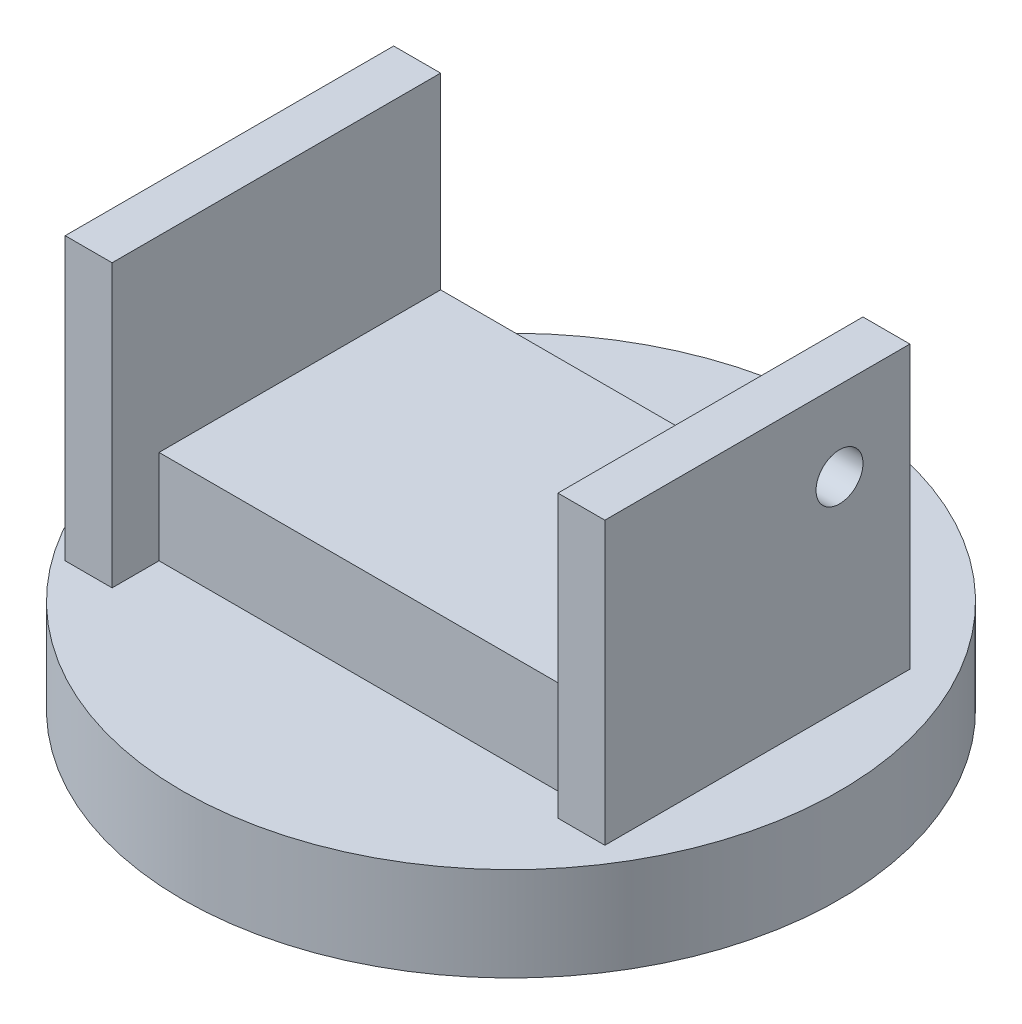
ISO-10303-21;
HEADER;
FILE_DESCRIPTION(('STEP AP214'),'2;1');
FILE_NAME('part.step','',(''),(''),'','','');
FILE_SCHEMA(('AUTOMOTIVE_DESIGN { 1 0 10303 214 1 1 1 1 }'));
ENDSEC;
DATA;
#1=APPLICATION_CONTEXT('core data for automotive mechanical design processes');
#2=APPLICATION_PROTOCOL_DEFINITION('international standard','automotive_design',2000,#1);
#3=PRODUCT_CONTEXT('',#1,'mechanical');
#4=PRODUCT('Part','Part','',(#3));
#5=PRODUCT_RELATED_PRODUCT_CATEGORY('part','',(#4));
#6=PRODUCT_DEFINITION_FORMATION('','',#4);
#7=PRODUCT_DEFINITION_CONTEXT('part definition',#1,'design');
#8=PRODUCT_DEFINITION('design','',#6,#7);
#9=PRODUCT_DEFINITION_SHAPE('','',#8);
#10=(LENGTH_UNIT() NAMED_UNIT(*) SI_UNIT(.MILLI.,.METRE.));
#11=(NAMED_UNIT(*) PLANE_ANGLE_UNIT() SI_UNIT($,.RADIAN.));
#12=(NAMED_UNIT(*) SI_UNIT($,.STERADIAN.) SOLID_ANGLE_UNIT());
#13=UNCERTAINTY_MEASURE_WITH_UNIT(LENGTH_MEASURE(1.E-05),#10,'distance_accuracy_value','');
#14=(GEOMETRIC_REPRESENTATION_CONTEXT(3) GLOBAL_UNCERTAINTY_ASSIGNED_CONTEXT((#13)) GLOBAL_UNIT_ASSIGNED_CONTEXT((#10,
#11,#12)) REPRESENTATION_CONTEXT('',''));
#15=CARTESIAN_POINT('',(0.,0.,0.));
#16=DIRECTION('',(0.,0.,1.));
#17=DIRECTION('',(1.,0.,0.));
#18=AXIS2_PLACEMENT_3D('',#15,#16,#17);
#19=CARTESIAN_POINT('',(0.,10.,0.));
#20=DIRECTION('',(0.,1.,0.));
#21=DIRECTION('',(0.,0.,1.));
#22=AXIS2_PLACEMENT_3D('',#19,#20,#21);
#23=PLANE('',#22);
#24=CARTESIAN_POINT('',(0.,10.,0.));
#25=DIRECTION('',(0.,1.,0.));
#26=DIRECTION('',(0.,0.,1.));
#27=AXIS2_PLACEMENT_3D('',#24,#25,#26);
#28=CIRCLE('',#27,35.);
#29=CARTESIAN_POINT('',(0.,10.,35.));
#30=VERTEX_POINT('',#29);
#31=EDGE_CURVE('E49',#30,#30,#28,.T.);
#32=ORIENTED_EDGE('',*,*,#31,.T.);
#33=EDGE_LOOP('',(#32));
#34=FACE_BOUND('',#33,.T.);
#35=DIRECTION('',(1.,0.,0.));
#36=VECTOR('',#35,1.);
#37=CARTESIAN_POINT('',(22.5,10.,17.5));
#38=LINE('',#37,#36);
#39=CARTESIAN_POINT('',(22.5,10.,17.5));
#40=VERTEX_POINT('',#39);
#41=CARTESIAN_POINT('',(27.5,10.,17.5));
#42=VERTEX_POINT('',#41);
#43=EDGE_CURVE('E277',#40,#42,#38,.T.);
#44=ORIENTED_EDGE('',*,*,#43,.F.);
#45=DIRECTION('',(0.,0.,1.));
#46=VECTOR('',#45,1.);
#47=CARTESIAN_POINT('',(22.5,10.,-15.));
#48=LINE('',#47,#46);
#49=CARTESIAN_POINT('',(22.5,10.,15.));
#50=VERTEX_POINT('',#49);
#51=EDGE_CURVE('E139',#50,#40,#48,.T.);
#52=ORIENTED_EDGE('',*,*,#51,.F.);
#53=DIRECTION('',(1.,0.,0.));
#54=VECTOR('',#53,1.);
#55=CARTESIAN_POINT('',(22.5,10.,15.));
#56=LINE('',#55,#54);
#57=CARTESIAN_POINT('',(-22.5,10.,15.));
#58=VERTEX_POINT('',#57);
#59=EDGE_CURVE('E172',#58,#50,#56,.T.);
#60=ORIENTED_EDGE('',*,*,#59,.F.);
#61=DIRECTION('',(0.,0.,-1.));
#62=VECTOR('',#61,1.);
#63=CARTESIAN_POINT('',(-22.5,10.,-15.));
#64=LINE('',#63,#62);
#65=CARTESIAN_POINT('',(-22.5,10.,20.));
#66=VERTEX_POINT('',#65);
#67=EDGE_CURVE('E140',#66,#58,#64,.T.);
#68=ORIENTED_EDGE('',*,*,#67,.F.);
#69=DIRECTION('',(1.,0.,0.));
#70=VECTOR('',#69,1.);
#71=CARTESIAN_POINT('',(-22.5,10.,20.));
#72=LINE('',#71,#70);
#73=CARTESIAN_POINT('',(-27.5,10.,20.));
#74=VERTEX_POINT('',#73);
#75=EDGE_CURVE('E152',#74,#66,#72,.T.);
#76=ORIENTED_EDGE('',*,*,#75,.F.);
#77=DIRECTION('',(0.,0.,1.));
#78=VECTOR('',#77,1.);
#79=CARTESIAN_POINT('',(-27.5,10.,-15.));
#80=LINE('',#79,#78);
#81=CARTESIAN_POINT('',(-27.5,10.,-15.));
#82=VERTEX_POINT('',#81);
#83=EDGE_CURVE('E142',#82,#74,#80,.T.);
#84=ORIENTED_EDGE('',*,*,#83,.F.);
#85=DIRECTION('',(-1.,0.,0.));
#86=VECTOR('',#85,1.);
#87=CARTESIAN_POINT('',(22.5,10.,-15.));
#88=LINE('',#87,#86);
#89=CARTESIAN_POINT('',(27.5,10.,-15.));
#90=VERTEX_POINT('',#89);
#91=EDGE_CURVE('E177',#90,#82,#88,.T.);
#92=ORIENTED_EDGE('',*,*,#91,.F.);
#93=DIRECTION('',(0.,0.,-1.));
#94=VECTOR('',#93,1.);
#95=CARTESIAN_POINT('',(27.5,10.,-15.));
#96=LINE('',#95,#94);
#97=EDGE_CURVE('E135',#42,#90,#96,.T.);
#98=ORIENTED_EDGE('',*,*,#97,.F.);
#99=EDGE_LOOP('',(#44,#52,#60,#68,#76,#84,#92,#98));
#100=FACE_BOUND('',#99,.T.);
#101=ADVANCED_FACE('F41',(#34,#100),#23,.T.);
#102=CARTESIAN_POINT('',(0.,10.,0.));
#103=DIRECTION('',(0.,-1.,0.));
#104=DIRECTION('',(0.,0.,-1.));
#105=AXIS2_PLACEMENT_3D('',#102,#103,#104);
#106=CYLINDRICAL_SURFACE('',#105,35.);
#107=ORIENTED_EDGE('',*,*,#31,.F.);
#108=EDGE_LOOP('',(#107));
#109=FACE_BOUND('',#108,.T.);
#110=CARTESIAN_POINT('',(0.,0.,0.));
#111=DIRECTION('',(0.,1.,0.));
#112=DIRECTION('',(0.,0.,1.));
#113=AXIS2_PLACEMENT_3D('',#110,#111,#112);
#114=CIRCLE('',#113,35.);
#115=CARTESIAN_POINT('',(0.,0.,35.));
#116=VERTEX_POINT('',#115);
#117=EDGE_CURVE('E191',#116,#116,#114,.T.);
#118=ORIENTED_EDGE('',*,*,#117,.T.);
#119=EDGE_LOOP('',(#118));
#120=FACE_BOUND('',#119,.T.);
#121=ADVANCED_FACE('F43',(#109,#120),#106,.T.);
#122=CARTESIAN_POINT('',(0.,0.,0.));
#123=DIRECTION('',(0.,1.,0.));
#124=DIRECTION('',(0.,0.,1.));
#125=AXIS2_PLACEMENT_3D('',#122,#123,#124);
#126=PLANE('',#125);
#127=ORIENTED_EDGE('',*,*,#117,.F.);
#128=EDGE_LOOP('',(#127));
#129=FACE_BOUND('',#128,.T.);
#130=ADVANCED_FACE('F197',(#129),#126,.F.);
#131=CARTESIAN_POINT('',(22.5,20.,15.));
#132=DIRECTION('',(0.,0.,-1.));
#133=DIRECTION('',(-1.,0.,0.));
#134=AXIS2_PLACEMENT_3D('',#131,#132,#133);
#135=PLANE('',#134);
#136=ORIENTED_EDGE('',*,*,#59,.T.);
#137=DIRECTION('',(0.,-1.,0.));
#138=VECTOR('',#137,1.);
#139=CARTESIAN_POINT('',(22.5,20.,15.));
#140=LINE('',#139,#138);
#141=CARTESIAN_POINT('',(22.5,20.,15.));
#142=VERTEX_POINT('',#141);
#143=EDGE_CURVE('E185',#142,#50,#140,.T.);
#144=ORIENTED_EDGE('',*,*,#143,.F.);
#145=DIRECTION('',(1.,0.,0.));
#146=VECTOR('',#145,1.);
#147=CARTESIAN_POINT('',(22.5,20.,15.));
#148=LINE('',#147,#146);
#149=CARTESIAN_POINT('',(-22.5,20.,15.));
#150=VERTEX_POINT('',#149);
#151=EDGE_CURVE('E176',#150,#142,#148,.T.);
#152=ORIENTED_EDGE('',*,*,#151,.F.);
#153=DIRECTION('',(0.,-1.,0.));
#154=VECTOR('',#153,1.);
#155=CARTESIAN_POINT('',(-22.5,20.,15.));
#156=LINE('',#155,#154);
#157=EDGE_CURVE('E64',#150,#58,#156,.T.);
#158=ORIENTED_EDGE('',*,*,#157,.T.);
#159=EDGE_LOOP('',(#136,#144,#152,#158));
#160=FACE_BOUND('',#159,.T.);
#161=ADVANCED_FACE('F199',(#160),#135,.F.);
#162=CARTESIAN_POINT('',(22.5,20.,-15.));
#163=DIRECTION('',(0.,0.,1.));
#164=DIRECTION('',(1.,0.,0.));
#165=AXIS2_PLACEMENT_3D('',#162,#163,#164);
#166=PLANE('',#165);
#167=ORIENTED_EDGE('',*,*,#91,.T.);
#168=DIRECTION('',(0.,-1.,0.));
#169=VECTOR('',#168,1.);
#170=CARTESIAN_POINT('',(-27.5,40.,-15.));
#171=LINE('',#170,#169);
#172=CARTESIAN_POINT('',(-27.5,40.,-15.));
#173=VERTEX_POINT('',#172);
#174=EDGE_CURVE('E166',#173,#82,#171,.T.);
#175=ORIENTED_EDGE('',*,*,#174,.F.);
#176=DIRECTION('',(-1.,0.,0.));
#177=VECTOR('',#176,1.);
#178=CARTESIAN_POINT('',(-22.5,40.,-15.));
#179=LINE('',#178,#177);
#180=CARTESIAN_POINT('',(-22.5,40.,-15.));
#181=VERTEX_POINT('',#180);
#182=EDGE_CURVE('E151',#181,#173,#179,.T.);
#183=ORIENTED_EDGE('',*,*,#182,.F.);
#184=DIRECTION('',(0.,-1.,0.));
#185=VECTOR('',#184,1.);
#186=CARTESIAN_POINT('',(-22.5,40.,-15.));
#187=LINE('',#186,#185);
#188=CARTESIAN_POINT('',(-22.5,20.,-15.));
#189=VERTEX_POINT('',#188);
#190=EDGE_CURVE('E169',#181,#189,#187,.T.);
#191=ORIENTED_EDGE('',*,*,#190,.T.);
#192=DIRECTION('',(-1.,0.,0.));
#193=VECTOR('',#192,1.);
#194=CARTESIAN_POINT('',(22.5,20.,-15.));
#195=LINE('',#194,#193);
#196=CARTESIAN_POINT('',(22.5,20.,-15.));
#197=VERTEX_POINT('',#196);
#198=EDGE_CURVE('E182',#197,#189,#195,.T.);
#199=ORIENTED_EDGE('',*,*,#198,.F.);
#200=DIRECTION('',(0.,-1.,0.));
#201=VECTOR('',#200,1.);
#202=CARTESIAN_POINT('',(22.5,40.,-15.));
#203=LINE('',#202,#201);
#204=CARTESIAN_POINT('',(22.5,40.,-15.));
#205=VERTEX_POINT('',#204);
#206=EDGE_CURVE('E56',#205,#197,#203,.T.);
#207=ORIENTED_EDGE('',*,*,#206,.F.);
#208=DIRECTION('',(-1.,0.,0.));
#209=VECTOR('',#208,1.);
#210=CARTESIAN_POINT('',(22.5,40.,-15.));
#211=LINE('',#210,#209);
#212=CARTESIAN_POINT('',(27.5,40.,-15.));
#213=VERTEX_POINT('',#212);
#214=EDGE_CURVE('E134',#213,#205,#211,.T.);
#215=ORIENTED_EDGE('',*,*,#214,.F.);
#216=DIRECTION('',(0.,-1.,0.));
#217=VECTOR('',#216,1.);
#218=CARTESIAN_POINT('',(27.5,40.,-15.));
#219=LINE('',#218,#217);
#220=EDGE_CURVE('E144',#213,#90,#219,.T.);
#221=ORIENTED_EDGE('',*,*,#220,.T.);
#222=EDGE_LOOP('',(#167,#175,#183,#191,#199,#207,#215,#221));
#223=FACE_BOUND('',#222,.T.);
#224=ADVANCED_FACE('F205',(#223),#166,.F.);
#225=CARTESIAN_POINT('',(0.,20.,0.));
#226=DIRECTION('',(0.,1.,0.));
#227=DIRECTION('',(0.,0.,1.));
#228=AXIS2_PLACEMENT_3D('',#225,#226,#227);
#229=PLANE('',#228);
#230=DIRECTION('',(0.,0.,1.));
#231=VECTOR('',#230,1.);
#232=CARTESIAN_POINT('',(-22.5,20.,15.));
#233=LINE('',#232,#231);
#234=EDGE_CURVE('E173',#189,#150,#233,.T.);
#235=ORIENTED_EDGE('',*,*,#234,.T.);
#236=ORIENTED_EDGE('',*,*,#151,.T.);
#237=DIRECTION('',(0.,0.,-1.));
#238=VECTOR('',#237,1.);
#239=CARTESIAN_POINT('',(22.5,20.,15.));
#240=LINE('',#239,#238);
#241=EDGE_CURVE('E180',#142,#197,#240,.T.);
#242=ORIENTED_EDGE('',*,*,#241,.T.);
#243=ORIENTED_EDGE('',*,*,#198,.T.);
#244=EDGE_LOOP('',(#235,#236,#242,#243));
#245=FACE_BOUND('',#244,.T.);
#246=ADVANCED_FACE('F219',(#245),#229,.T.);
#247=CARTESIAN_POINT('',(-22.5,40.,-15.));
#248=DIRECTION('',(-1.,0.,0.));
#249=DIRECTION('',(0.,0.,1.));
#250=AXIS2_PLACEMENT_3D('',#247,#248,#249);
#251=PLANE('',#250);
#252=ORIENTED_EDGE('',*,*,#67,.T.);
#253=ORIENTED_EDGE('',*,*,#157,.F.);
#254=ORIENTED_EDGE('',*,*,#234,.F.);
#255=ORIENTED_EDGE('',*,*,#190,.F.);
#256=DIRECTION('',(0.,0.,-1.));
#257=VECTOR('',#256,1.);
#258=CARTESIAN_POINT('',(-22.5,40.,-15.));
#259=LINE('',#258,#257);
#260=CARTESIAN_POINT('',(-22.5,40.,20.));
#261=VERTEX_POINT('',#260);
#262=EDGE_CURVE('E148',#261,#181,#259,.T.);
#263=ORIENTED_EDGE('',*,*,#262,.F.);
#264=DIRECTION('',(0.,-1.,0.));
#265=VECTOR('',#264,1.);
#266=CARTESIAN_POINT('',(-22.5,40.,20.));
#267=LINE('',#266,#265);
#268=EDGE_CURVE('E157',#261,#66,#267,.T.);
#269=ORIENTED_EDGE('',*,*,#268,.T.);
#270=EDGE_LOOP('',(#252,#253,#254,#255,#263,#269));
#271=FACE_BOUND('',#270,.T.);
#272=ADVANCED_FACE('F223',(#271),#251,.F.);
#273=CARTESIAN_POINT('',(-27.5,40.,-15.));
#274=DIRECTION('',(1.,0.,0.));
#275=DIRECTION('',(0.,0.,-1.));
#276=AXIS2_PLACEMENT_3D('',#273,#274,#275);
#277=PLANE('',#276);
#278=CARTESIAN_POINT('',(-27.5,31.5,-7.5));
#279=DIRECTION('',(1.,0.,0.));
#280=DIRECTION('',(0.,0.,-1.));
#281=AXIS2_PLACEMENT_3D('',#278,#279,#280);
#282=CIRCLE('',#281,2.4);
#283=CARTESIAN_POINT('',(-27.5,31.5,-9.9));
#284=VERTEX_POINT('',#283);
#285=EDGE_CURVE('E11',#284,#284,#282,.F.);
#286=ORIENTED_EDGE('',*,*,#285,.F.);
#287=EDGE_LOOP('',(#286));
#288=FACE_BOUND('',#287,.T.);
#289=ORIENTED_EDGE('',*,*,#83,.T.);
#290=DIRECTION('',(0.,-1.,0.));
#291=VECTOR('',#290,1.);
#292=CARTESIAN_POINT('',(-27.5,40.,20.));
#293=LINE('',#292,#291);
#294=CARTESIAN_POINT('',(-27.5,40.,20.));
#295=VERTEX_POINT('',#294);
#296=EDGE_CURVE('E163',#295,#74,#293,.T.);
#297=ORIENTED_EDGE('',*,*,#296,.F.);
#298=DIRECTION('',(0.,0.,1.));
#299=VECTOR('',#298,1.);
#300=CARTESIAN_POINT('',(-27.5,40.,-15.));
#301=LINE('',#300,#299);
#302=EDGE_CURVE('E154',#173,#295,#301,.T.);
#303=ORIENTED_EDGE('',*,*,#302,.F.);
#304=ORIENTED_EDGE('',*,*,#174,.T.);
#305=EDGE_LOOP('',(#289,#297,#303,#304));
#306=FACE_BOUND('',#305,.T.);
#307=ADVANCED_FACE('F226',(#288,#306),#277,.F.);
#308=CARTESIAN_POINT('',(-22.5,40.,20.));
#309=DIRECTION('',(0.,0.,-1.));
#310=DIRECTION('',(-1.,0.,0.));
#311=AXIS2_PLACEMENT_3D('',#308,#309,#310);
#312=PLANE('',#311);
#313=ORIENTED_EDGE('',*,*,#75,.T.);
#314=ORIENTED_EDGE('',*,*,#268,.F.);
#315=DIRECTION('',(1.,0.,0.));
#316=VECTOR('',#315,1.);
#317=CARTESIAN_POINT('',(-22.5,40.,20.));
#318=LINE('',#317,#316);
#319=EDGE_CURVE('E156',#295,#261,#318,.T.);
#320=ORIENTED_EDGE('',*,*,#319,.F.);
#321=ORIENTED_EDGE('',*,*,#296,.T.);
#322=EDGE_LOOP('',(#313,#314,#320,#321));
#323=FACE_BOUND('',#322,.T.);
#324=ADVANCED_FACE('F229',(#323),#312,.F.);
#325=CARTESIAN_POINT('',(0.,40.,0.));
#326=DIRECTION('',(0.,-1.,0.));
#327=DIRECTION('',(0.,0.,-1.));
#328=AXIS2_PLACEMENT_3D('',#325,#326,#327);
#329=PLANE('',#328);
#330=ORIENTED_EDGE('',*,*,#262,.T.);
#331=ORIENTED_EDGE('',*,*,#182,.T.);
#332=ORIENTED_EDGE('',*,*,#302,.T.);
#333=ORIENTED_EDGE('',*,*,#319,.T.);
#334=EDGE_LOOP('',(#330,#331,#332,#333));
#335=FACE_BOUND('',#334,.T.);
#336=ADVANCED_FACE('F233',(#335),#329,.F.);
#337=CARTESIAN_POINT('',(22.5,40.,-15.));
#338=DIRECTION('',(1.,0.,0.));
#339=DIRECTION('',(0.,0.,-1.));
#340=AXIS2_PLACEMENT_3D('',#337,#338,#339);
#341=PLANE('',#340);
#342=CARTESIAN_POINT('',(22.5,31.5,-7.5));
#343=DIRECTION('',(1.,0.,0.));
#344=DIRECTION('',(0.,0.,-1.));
#345=AXIS2_PLACEMENT_3D('',#342,#343,#344);
#346=CIRCLE('',#345,2.5);
#347=CARTESIAN_POINT('',(22.5,31.5,-10.));
#348=VERTEX_POINT('',#347);
#349=EDGE_CURVE('E264',#348,#348,#346,.T.);
#350=ORIENTED_EDGE('',*,*,#349,.T.);
#351=EDGE_LOOP('',(#350));
#352=FACE_BOUND('',#351,.T.);
#353=ORIENTED_EDGE('',*,*,#241,.F.);
#354=ORIENTED_EDGE('',*,*,#143,.T.);
#355=ORIENTED_EDGE('',*,*,#51,.T.);
#356=DIRECTION('',(0.,-1.,0.));
#357=VECTOR('',#356,1.);
#358=CARTESIAN_POINT('',(22.5,40.,17.5));
#359=LINE('',#358,#357);
#360=CARTESIAN_POINT('',(22.5,40.,17.5));
#361=VERTEX_POINT('',#360);
#362=EDGE_CURVE('E123',#361,#40,#359,.T.);
#363=ORIENTED_EDGE('',*,*,#362,.F.);
#364=DIRECTION('',(0.,0.,1.));
#365=VECTOR('',#364,1.);
#366=CARTESIAN_POINT('',(22.5,40.,-15.));
#367=LINE('',#366,#365);
#368=EDGE_CURVE('E130',#205,#361,#367,.T.);
#369=ORIENTED_EDGE('',*,*,#368,.F.);
#370=ORIENTED_EDGE('',*,*,#206,.T.);
#371=EDGE_LOOP('',(#353,#354,#355,#363,#369,#370));
#372=FACE_BOUND('',#371,.T.);
#373=ADVANCED_FACE('F137',(#352,#372),#341,.F.);
#374=CARTESIAN_POINT('',(22.5,40.,17.5));
#375=DIRECTION('',(0.,0.,-1.));
#376=DIRECTION('',(-1.,0.,0.));
#377=AXIS2_PLACEMENT_3D('',#374,#375,#376);
#378=PLANE('',#377);
#379=ORIENTED_EDGE('',*,*,#43,.T.);
#380=DIRECTION('',(0.,-1.,0.));
#381=VECTOR('',#380,1.);
#382=CARTESIAN_POINT('',(27.5,40.,17.5));
#383=LINE('',#382,#381);
#384=CARTESIAN_POINT('',(27.5,40.,17.5));
#385=VERTEX_POINT('',#384);
#386=EDGE_CURVE('E126',#385,#42,#383,.T.);
#387=ORIENTED_EDGE('',*,*,#386,.F.);
#388=DIRECTION('',(1.,0.,0.));
#389=VECTOR('',#388,1.);
#390=CARTESIAN_POINT('',(22.5,40.,17.5));
#391=LINE('',#390,#389);
#392=EDGE_CURVE('E119',#361,#385,#391,.T.);
#393=ORIENTED_EDGE('',*,*,#392,.F.);
#394=ORIENTED_EDGE('',*,*,#362,.T.);
#395=EDGE_LOOP('',(#379,#387,#393,#394));
#396=FACE_BOUND('',#395,.T.);
#397=ADVANCED_FACE('F121',(#396),#378,.F.);
#398=CARTESIAN_POINT('',(27.5,40.,-15.));
#399=DIRECTION('',(-1.,0.,0.));
#400=DIRECTION('',(0.,0.,1.));
#401=AXIS2_PLACEMENT_3D('',#398,#399,#400);
#402=PLANE('',#401);
#403=CARTESIAN_POINT('',(27.5,31.5,-7.5));
#404=DIRECTION('',(1.,0.,0.));
#405=DIRECTION('',(0.,0.,-1.));
#406=AXIS2_PLACEMENT_3D('',#403,#404,#405);
#407=CIRCLE('',#406,2.5);
#408=CARTESIAN_POINT('',(27.5,31.5,-10.));
#409=VERTEX_POINT('',#408);
#410=EDGE_CURVE('E267',#409,#409,#407,.T.);
#411=ORIENTED_EDGE('',*,*,#410,.F.);
#412=EDGE_LOOP('',(#411));
#413=FACE_BOUND('',#412,.T.);
#414=ORIENTED_EDGE('',*,*,#97,.T.);
#415=ORIENTED_EDGE('',*,*,#220,.F.);
#416=DIRECTION('',(0.,0.,-1.));
#417=VECTOR('',#416,1.);
#418=CARTESIAN_POINT('',(27.5,40.,-15.));
#419=LINE('',#418,#417);
#420=EDGE_CURVE('E129',#385,#213,#419,.T.);
#421=ORIENTED_EDGE('',*,*,#420,.F.);
#422=ORIENTED_EDGE('',*,*,#386,.T.);
#423=EDGE_LOOP('',(#414,#415,#421,#422));
#424=FACE_BOUND('',#423,.T.);
#425=ADVANCED_FACE('F242',(#413,#424),#402,.F.);
#426=CARTESIAN_POINT('',(0.,40.,0.));
#427=DIRECTION('',(0.,1.,0.));
#428=DIRECTION('',(0.,0.,1.));
#429=AXIS2_PLACEMENT_3D('',#426,#427,#428);
#430=PLANE('',#429);
#431=ORIENTED_EDGE('',*,*,#368,.T.);
#432=ORIENTED_EDGE('',*,*,#392,.T.);
#433=ORIENTED_EDGE('',*,*,#420,.T.);
#434=ORIENTED_EDGE('',*,*,#214,.T.);
#435=EDGE_LOOP('',(#431,#432,#433,#434));
#436=FACE_BOUND('',#435,.T.);
#437=ADVANCED_FACE('F132',(#436),#430,.T.);
#438=CARTESIAN_POINT('',(-32.5,31.5,-7.5));
#439=DIRECTION('',(1.,0.,0.));
#440=DIRECTION('',(0.,0.,-1.));
#441=AXIS2_PLACEMENT_3D('',#438,#439,#440);
#442=CYLINDRICAL_SURFACE('',#441,2.4);
#443=CARTESIAN_POINT('',(-32.5,31.5,-7.5));
#444=DIRECTION('',(-1.,0.,0.));
#445=DIRECTION('',(0.,0.,1.));
#446=AXIS2_PLACEMENT_3D('',#443,#444,#445);
#447=CIRCLE('',#446,2.4);
#448=CARTESIAN_POINT('',(-32.5,31.5,-5.1));
#449=VERTEX_POINT('',#448);
#450=EDGE_CURVE('E269',#449,#449,#447,.T.);
#451=ORIENTED_EDGE('',*,*,#450,.F.);
#452=EDGE_LOOP('',(#451));
#453=FACE_BOUND('',#452,.T.);
#454=ORIENTED_EDGE('',*,*,#285,.T.);
#455=EDGE_LOOP('',(#454));
#456=FACE_BOUND('',#455,.T.);
#457=ADVANCED_FACE('F248',(#453,#456),#442,.T.);
#458=CARTESIAN_POINT('',(-32.5,31.5,-7.5));
#459=DIRECTION('',(-1.,0.,0.));
#460=DIRECTION('',(0.,0.,1.));
#461=AXIS2_PLACEMENT_3D('',#458,#459,#460);
#462=PLANE('',#461);
#463=ORIENTED_EDGE('',*,*,#450,.T.);
#464=EDGE_LOOP('',(#463));
#465=FACE_BOUND('',#464,.T.);
#466=ADVANCED_FACE('F251',(#465),#462,.T.);
#467=CARTESIAN_POINT('',(22.5,31.5,-7.5));
#468=DIRECTION('',(1.,0.,0.));
#469=DIRECTION('',(0.,0.,-1.));
#470=AXIS2_PLACEMENT_3D('',#467,#468,#469);
#471=CYLINDRICAL_SURFACE('',#470,2.5);
#472=ORIENTED_EDGE('',*,*,#349,.F.);
#473=EDGE_LOOP('',(#472));
#474=FACE_BOUND('',#473,.T.);
#475=ORIENTED_EDGE('',*,*,#410,.T.);
#476=EDGE_LOOP('',(#475));
#477=FACE_BOUND('',#476,.T.);
#478=ADVANCED_FACE('F255',(#474,#477),#471,.F.);
#479=CLOSED_SHELL('',(#101,#121,#130,#161,#224,#246,#272,#307,#324,#336,#373,#397,#425,#437,
#457,#466,#478));
#480=MANIFOLD_SOLID_BREP('B2',#479);
#481=ADVANCED_BREP_SHAPE_REPRESENTATION('',(#18,#480),#14);
#482=SHAPE_DEFINITION_REPRESENTATION(#9,#481);
ENDSEC;
END-ISO-10303-21;
